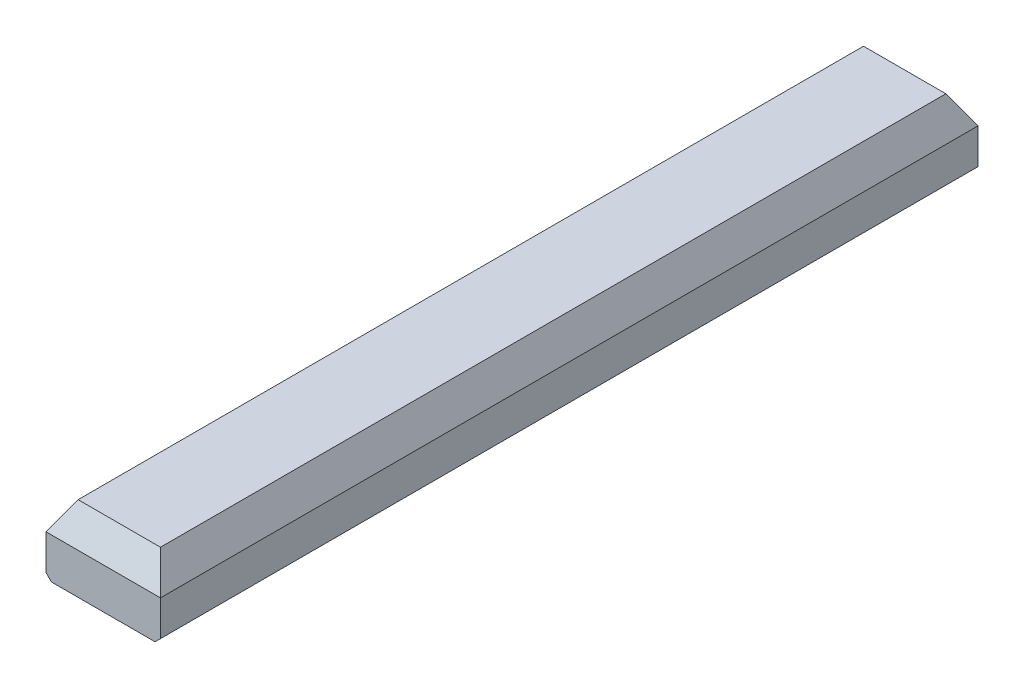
ISO-10303-21;
HEADER;
FILE_DESCRIPTION(('STEP AP214'),'2;1');
FILE_NAME('part.step','',(''),(''),'','','');
FILE_SCHEMA(('AUTOMOTIVE_DESIGN { 1 0 10303 214 1 1 1 1 }'));
ENDSEC;
DATA;
#1=APPLICATION_CONTEXT('core data for automotive mechanical design processes');
#2=APPLICATION_PROTOCOL_DEFINITION('international standard','automotive_design',2000,#1);
#3=PRODUCT_CONTEXT('',#1,'mechanical');
#4=PRODUCT('Part','Part','',(#3));
#5=PRODUCT_RELATED_PRODUCT_CATEGORY('part','',(#4));
#6=PRODUCT_DEFINITION_FORMATION('','',#4);
#7=PRODUCT_DEFINITION_CONTEXT('part definition',#1,'design');
#8=PRODUCT_DEFINITION('design','',#6,#7);
#9=PRODUCT_DEFINITION_SHAPE('','',#8);
#10=(LENGTH_UNIT() NAMED_UNIT(*) SI_UNIT(.MILLI.,.METRE.));
#11=(NAMED_UNIT(*) PLANE_ANGLE_UNIT() SI_UNIT($,.RADIAN.));
#12=(NAMED_UNIT(*) SI_UNIT($,.STERADIAN.) SOLID_ANGLE_UNIT());
#13=UNCERTAINTY_MEASURE_WITH_UNIT(LENGTH_MEASURE(1.E-05),#10,'distance_accuracy_value','');
#14=(GEOMETRIC_REPRESENTATION_CONTEXT(3) GLOBAL_UNCERTAINTY_ASSIGNED_CONTEXT((#13)) GLOBAL_UNIT_ASSIGNED_CONTEXT((#10,
#11,#12)) REPRESENTATION_CONTEXT('',''));
#15=CARTESIAN_POINT('',(0.,0.,0.));
#16=DIRECTION('',(0.,0.,1.));
#17=DIRECTION('',(1.,0.,0.));
#18=AXIS2_PLACEMENT_3D('',#15,#16,#17);
#19=CARTESIAN_POINT('',(158.4325,191.389,1131.55));
#20=DIRECTION('',(0.,-1.,0.));
#21=DIRECTION('',(0.,0.,-1.));
#22=AXIS2_PLACEMENT_3D('',#19,#20,#21);
#23=PLANE('',#22);
#24=DIRECTION('',(1.,0.,0.));
#25=VECTOR('',#24,1.);
#26=CARTESIAN_POINT('',(158.4325,191.389,1087.1));
#27=LINE('',#26,#25);
#28=CARTESIAN_POINT('',(-113.9825,191.389,1087.1));
#29=VERTEX_POINT('',#28);
#30=CARTESIAN_POINT('',(113.9825,191.389,1087.1));
#31=VERTEX_POINT('',#30);
#32=EDGE_CURVE('E176',#29,#31,#27,.T.);
#33=ORIENTED_EDGE('',*,*,#32,.T.);
#34=DIRECTION('',(0.,0.,-1.));
#35=VECTOR('',#34,1.);
#36=CARTESIAN_POINT('',(113.9825,191.389,1131.55));
#37=LINE('',#36,#35);
#38=CARTESIAN_POINT('',(113.9825,191.389,-1087.1));
#39=VERTEX_POINT('',#38);
#40=EDGE_CURVE('E177',#31,#39,#37,.T.);
#41=ORIENTED_EDGE('',*,*,#40,.T.);
#42=DIRECTION('',(-1.,0.,0.));
#43=VECTOR('',#42,1.);
#44=CARTESIAN_POINT('',(158.4325,191.389,-1087.1));
#45=LINE('',#44,#43);
#46=CARTESIAN_POINT('',(-113.9825,191.389,-1087.1));
#47=VERTEX_POINT('',#46);
#48=EDGE_CURVE('E167',#39,#47,#45,.T.);
#49=ORIENTED_EDGE('',*,*,#48,.T.);
#50=DIRECTION('',(0.,0.,1.));
#51=VECTOR('',#50,1.);
#52=CARTESIAN_POINT('',(-113.9825,191.389,1131.55));
#53=LINE('',#52,#51);
#54=EDGE_CURVE('E173',#47,#29,#53,.T.);
#55=ORIENTED_EDGE('',*,*,#54,.T.);
#56=EDGE_LOOP('',(#33,#41,#49,#55));
#57=FACE_BOUND('',#56,.T.);
#58=ADVANCED_FACE('F50',(#57),#23,.F.);
#59=CARTESIAN_POINT('',(-158.4325,191.389,1131.55));
#60=DIRECTION('',(1.,0.,0.));
#61=DIRECTION('',(0.,1.,0.));
#62=AXIS2_PLACEMENT_3D('',#59,#60,#61);
#63=PLANE('',#62);
#64=DIRECTION('',(0.,-1.,0.));
#65=VECTOR('',#64,1.);
#66=CARTESIAN_POINT('',(-158.4325,191.389,1131.55));
#67=LINE('',#66,#65);
#68=CARTESIAN_POINT('',(-158.4325,114.399341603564,1131.55));
#69=VERTEX_POINT('',#68);
#70=CARTESIAN_POINT('',(-158.4325,16.5875000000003,1131.55));
#71=VERTEX_POINT('',#70);
#72=EDGE_CURVE('E149',#69,#71,#67,.T.);
#73=ORIENTED_EDGE('',*,*,#72,.F.);
#74=DIRECTION('',(0.,0.,-1.));
#75=VECTOR('',#74,1.);
#76=CARTESIAN_POINT('',(-158.4325,114.399341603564,1131.55));
#77=LINE('',#76,#75);
#78=CARTESIAN_POINT('',(-158.4325,114.399341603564,-1131.55));
#79=VERTEX_POINT('',#78);
#80=EDGE_CURVE('E59',#69,#79,#77,.T.);
#81=ORIENTED_EDGE('',*,*,#80,.T.);
#82=DIRECTION('',(0.,-1.,0.));
#83=VECTOR('',#82,1.);
#84=CARTESIAN_POINT('',(-158.4325,191.389,-1131.55));
#85=LINE('',#84,#83);
#86=CARTESIAN_POINT('',(-158.4325,16.5875000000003,-1131.55));
#87=VERTEX_POINT('',#86);
#88=EDGE_CURVE('E141',#79,#87,#85,.T.);
#89=ORIENTED_EDGE('',*,*,#88,.T.);
#90=DIRECTION('',(0.,0.,1.));
#91=VECTOR('',#90,1.);
#92=CARTESIAN_POINT('',(-158.4325,16.5875000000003,1131.55));
#93=LINE('',#92,#91);
#94=EDGE_CURVE('E125',#87,#71,#93,.T.);
#95=ORIENTED_EDGE('',*,*,#94,.T.);
#96=EDGE_LOOP('',(#73,#81,#89,#95));
#97=FACE_BOUND('',#96,.T.);
#98=ADVANCED_FACE('F222',(#97),#63,.F.);
#99=CARTESIAN_POINT('',(-158.4325,1.58750000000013,1131.55));
#100=DIRECTION('',(0.,1.,0.));
#101=DIRECTION('',(-1.,0.,0.));
#102=AXIS2_PLACEMENT_3D('',#99,#100,#101);
#103=PLANE('',#102);
#104=DIRECTION('',(1.,0.,0.));
#105=VECTOR('',#104,1.);
#106=CARTESIAN_POINT('',(-158.4325,1.58750000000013,1131.55));
#107=LINE('',#106,#105);
#108=CARTESIAN_POINT('',(-143.4325,1.58750000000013,1131.55));
#109=VERTEX_POINT('',#108);
#110=CARTESIAN_POINT('',(143.4325,1.58750000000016,1131.55));
#111=VERTEX_POINT('',#110);
#112=EDGE_CURVE('E133',#109,#111,#107,.T.);
#113=ORIENTED_EDGE('',*,*,#112,.F.);
#114=DIRECTION('',(0.,0.,-1.));
#115=VECTOR('',#114,1.);
#116=CARTESIAN_POINT('',(-143.4325,1.58750000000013,1131.55));
#117=LINE('',#116,#115);
#118=CARTESIAN_POINT('',(-143.4325,1.58750000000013,-1131.55));
#119=VERTEX_POINT('',#118);
#120=EDGE_CURVE('E119',#109,#119,#117,.T.);
#121=ORIENTED_EDGE('',*,*,#120,.T.);
#122=DIRECTION('',(1.,0.,0.));
#123=VECTOR('',#122,1.);
#124=CARTESIAN_POINT('',(-158.4325,1.58750000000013,-1131.55));
#125=LINE('',#124,#123);
#126=CARTESIAN_POINT('',(143.4325,1.58750000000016,-1131.55));
#127=VERTEX_POINT('',#126);
#128=EDGE_CURVE('E135',#119,#127,#125,.T.);
#129=ORIENTED_EDGE('',*,*,#128,.T.);
#130=DIRECTION('',(0.,0.,1.));
#131=VECTOR('',#130,1.);
#132=CARTESIAN_POINT('',(143.4325,1.58750000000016,1131.55));
#133=LINE('',#132,#131);
#134=EDGE_CURVE('E140',#127,#111,#133,.T.);
#135=ORIENTED_EDGE('',*,*,#134,.T.);
#136=EDGE_LOOP('',(#113,#121,#129,#135));
#137=FACE_BOUND('',#136,.T.);
#138=ADVANCED_FACE('F132',(#137),#103,.F.);
#139=CARTESIAN_POINT('',(158.4325,1.58750000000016,1131.55));
#140=DIRECTION('',(-1.,0.,0.));
#141=DIRECTION('',(0.,0.,1.));
#142=AXIS2_PLACEMENT_3D('',#139,#140,#141);
#143=PLANE('',#142);
#144=DIRECTION('',(0.,1.,0.));
#145=VECTOR('',#144,1.);
#146=CARTESIAN_POINT('',(158.4325,1.58750000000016,-1131.55));
#147=LINE('',#146,#145);
#148=CARTESIAN_POINT('',(158.4325,16.5875000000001,-1131.55));
#149=VERTEX_POINT('',#148);
#150=CARTESIAN_POINT('',(158.4325,114.399341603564,-1131.55));
#151=VERTEX_POINT('',#150);
#152=EDGE_CURVE('E145',#149,#151,#147,.T.);
#153=ORIENTED_EDGE('',*,*,#152,.T.);
#154=DIRECTION('',(0.,0.,1.));
#155=VECTOR('',#154,1.);
#156=CARTESIAN_POINT('',(158.4325,114.399341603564,1131.55));
#157=LINE('',#156,#155);
#158=CARTESIAN_POINT('',(158.4325,114.399341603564,1131.55));
#159=VERTEX_POINT('',#158);
#160=EDGE_CURVE('E182',#151,#159,#157,.T.);
#161=ORIENTED_EDGE('',*,*,#160,.T.);
#162=DIRECTION('',(0.,1.,0.));
#163=VECTOR('',#162,1.);
#164=CARTESIAN_POINT('',(158.4325,1.58750000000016,1131.55));
#165=LINE('',#164,#163);
#166=CARTESIAN_POINT('',(158.4325,16.5875000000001,1131.55));
#167=VERTEX_POINT('',#166);
#168=EDGE_CURVE('E151',#167,#159,#165,.T.);
#169=ORIENTED_EDGE('',*,*,#168,.F.);
#170=DIRECTION('',(0.,0.,-1.));
#171=VECTOR('',#170,1.);
#172=CARTESIAN_POINT('',(158.4325,16.5875000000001,1131.55));
#173=LINE('',#172,#171);
#174=EDGE_CURVE('E168',#167,#149,#173,.T.);
#175=ORIENTED_EDGE('',*,*,#174,.T.);
#176=EDGE_LOOP('',(#153,#161,#169,#175));
#177=FACE_BOUND('',#176,.T.);
#178=ADVANCED_FACE('F217',(#177),#143,.F.);
#179=CARTESIAN_POINT('',(0.,0.,1131.55));
#180=DIRECTION('',(0.,0.,1.));
#181=DIRECTION('',(1.,0.,0.));
#182=AXIS2_PLACEMENT_3D('',#179,#180,#181);
#183=PLANE('',#182);
#184=ORIENTED_EDGE('',*,*,#168,.T.);
#185=DIRECTION('',(-1.,0.,0.));
#186=VECTOR('',#185,1.);
#187=CARTESIAN_POINT('',(-158.4325,114.399341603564,1131.55));
#188=LINE('',#187,#186);
#189=EDGE_CURVE('E71',#159,#69,#188,.T.);
#190=ORIENTED_EDGE('',*,*,#189,.T.);
#191=ORIENTED_EDGE('',*,*,#72,.T.);
#192=DIRECTION('',(-0.707106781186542,0.707106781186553,0.));
#193=VECTOR('',#192,1.);
#194=CARTESIAN_POINT('',(-70.922500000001,-70.9225,1131.55));
#195=LINE('',#194,#193);
#196=EDGE_CURVE('E161',#71,#109,#195,.F.);
#197=ORIENTED_EDGE('',*,*,#196,.T.);
#198=ORIENTED_EDGE('',*,*,#112,.T.);
#199=DIRECTION('',(-0.707106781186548,-0.707106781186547,0.));
#200=VECTOR('',#199,1.);
#201=CARTESIAN_POINT('',(70.9224999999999,-70.9225,1131.55));
#202=LINE('',#201,#200);
#203=EDGE_CURVE('E159',#111,#167,#202,.F.);
#204=ORIENTED_EDGE('',*,*,#203,.T.);
#205=EDGE_LOOP('',(#184,#190,#191,#197,#198,#204));
#206=FACE_BOUND('',#205,.T.);
#207=ADVANCED_FACE('F269',(#206),#183,.T.);
#208=CARTESIAN_POINT('',(0.,0.,-1131.55));
#209=DIRECTION('',(0.,0.,1.));
#210=DIRECTION('',(1.,0.,0.));
#211=AXIS2_PLACEMENT_3D('',#208,#209,#210);
#212=PLANE('',#211);
#213=ORIENTED_EDGE('',*,*,#88,.F.);
#214=DIRECTION('',(1.,0.,0.));
#215=VECTOR('',#214,1.);
#216=CARTESIAN_POINT('',(0.,114.399341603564,-1131.55));
#217=LINE('',#216,#215);
#218=EDGE_CURVE('E11',#79,#151,#217,.T.);
#219=ORIENTED_EDGE('',*,*,#218,.T.);
#220=ORIENTED_EDGE('',*,*,#152,.F.);
#221=DIRECTION('',(0.707106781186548,0.707106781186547,0.));
#222=VECTOR('',#221,1.);
#223=CARTESIAN_POINT('',(158.4325,16.5875000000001,-1131.55));
#224=LINE('',#223,#222);
#225=EDGE_CURVE('E127',#149,#127,#224,.F.);
#226=ORIENTED_EDGE('',*,*,#225,.T.);
#227=ORIENTED_EDGE('',*,*,#128,.F.);
#228=DIRECTION('',(0.707106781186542,-0.707106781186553,0.));
#229=VECTOR('',#228,1.);
#230=CARTESIAN_POINT('',(-143.4325,1.58750000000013,-1131.55));
#231=LINE('',#230,#229);
#232=EDGE_CURVE('E116',#119,#87,#231,.F.);
#233=ORIENTED_EDGE('',*,*,#232,.T.);
#234=EDGE_LOOP('',(#213,#219,#220,#226,#227,#233));
#235=FACE_BOUND('',#234,.T.);
#236=ADVANCED_FACE('F137',(#235),#212,.F.);
#237=CARTESIAN_POINT('',(-143.4325,1.58750000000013,1131.55));
#238=DIRECTION('',(0.707106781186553,0.707106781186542,0.));
#239=DIRECTION('',(0.,0.,-1.));
#240=AXIS2_PLACEMENT_3D('',#237,#238,#239);
#241=PLANE('',#240);
#242=ORIENTED_EDGE('',*,*,#196,.F.);
#243=ORIENTED_EDGE('',*,*,#94,.F.);
#244=ORIENTED_EDGE('',*,*,#232,.F.);
#245=ORIENTED_EDGE('',*,*,#120,.F.);
#246=EDGE_LOOP('',(#242,#243,#244,#245));
#247=FACE_BOUND('',#246,.T.);
#248=ADVANCED_FACE('F118',(#247),#241,.F.);
#249=CARTESIAN_POINT('',(158.4325,16.5875000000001,1131.55));
#250=DIRECTION('',(-0.707106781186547,0.707106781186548,0.));
#251=DIRECTION('',(0.,0.,-1.));
#252=AXIS2_PLACEMENT_3D('',#249,#250,#251);
#253=PLANE('',#252);
#254=ORIENTED_EDGE('',*,*,#203,.F.);
#255=ORIENTED_EDGE('',*,*,#134,.F.);
#256=ORIENTED_EDGE('',*,*,#225,.F.);
#257=ORIENTED_EDGE('',*,*,#174,.F.);
#258=EDGE_LOOP('',(#254,#255,#256,#257));
#259=FACE_BOUND('',#258,.T.);
#260=ADVANCED_FACE('F237',(#259),#253,.F.);
#261=CARTESIAN_POINT('',(-158.4325,114.399341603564,1131.55));
#262=DIRECTION('',(0.866025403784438,-0.500000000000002,0.));
#263=DIRECTION('',(0.,0.,-1.));
#264=AXIS2_PLACEMENT_3D('',#261,#262,#263);
#265=PLANE('',#264);
#266=DIRECTION('',(0.447213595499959,0.774596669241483,0.447213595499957));
#267=VECTOR('',#266,1.);
#268=CARTESIAN_POINT('',(-59.4994999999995,285.756324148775,-1032.617));
#269=LINE('',#268,#267);
#270=EDGE_CURVE('E197',#79,#47,#269,.T.);
#271=ORIENTED_EDGE('',*,*,#270,.F.);
#272=ORIENTED_EDGE('',*,*,#80,.F.);
#273=DIRECTION('',(-0.447213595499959,-0.774596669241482,0.447213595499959));
#274=VECTOR('',#273,1.);
#275=CARTESIAN_POINT('',(-158.4325,114.399341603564,1131.55));
#276=LINE('',#275,#274);
#277=EDGE_CURVE('E55',#29,#69,#276,.T.);
#278=ORIENTED_EDGE('',*,*,#277,.F.);
#279=ORIENTED_EDGE('',*,*,#54,.F.);
#280=EDGE_LOOP('',(#271,#272,#278,#279));
#281=FACE_BOUND('',#280,.T.);
#282=ADVANCED_FACE('F49',(#281),#265,.F.);
#283=CARTESIAN_POINT('',(0.,114.399341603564,1131.55));
#284=DIRECTION('',(0.,0.500000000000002,0.866025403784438));
#285=DIRECTION('',(1.,0.,0.));
#286=AXIS2_PLACEMENT_3D('',#283,#284,#285);
#287=PLANE('',#286);
#288=ORIENTED_EDGE('',*,*,#277,.T.);
#289=ORIENTED_EDGE('',*,*,#189,.F.);
#290=DIRECTION('',(0.447213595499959,-0.774596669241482,0.447213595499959));
#291=VECTOR('',#290,1.);
#292=CARTESIAN_POINT('',(126.746,169.281969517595,1099.8635));
#293=LINE('',#292,#291);
#294=EDGE_CURVE('E191',#31,#159,#293,.T.);
#295=ORIENTED_EDGE('',*,*,#294,.F.);
#296=ORIENTED_EDGE('',*,*,#32,.F.);
#297=EDGE_LOOP('',(#288,#289,#295,#296));
#298=FACE_BOUND('',#297,.T.);
#299=ADVANCED_FACE('F206',(#298),#287,.T.);
#300=CARTESIAN_POINT('',(158.4325,191.389,-1087.1));
#301=DIRECTION('',(0.,-0.5,0.866025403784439));
#302=DIRECTION('',(-1.,0.,0.));
#303=AXIS2_PLACEMENT_3D('',#300,#301,#302);
#304=PLANE('',#303);
#305=ORIENTED_EDGE('',*,*,#270,.T.);
#306=ORIENTED_EDGE('',*,*,#48,.F.);
#307=DIRECTION('',(0.447213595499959,-0.774596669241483,-0.447213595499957));
#308=VECTOR('',#307,1.);
#309=CARTESIAN_POINT('',(122.8725,175.991068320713,-1095.99));
#310=LINE('',#309,#308);
#311=EDGE_CURVE('E192',#151,#39,#310,.F.);
#312=ORIENTED_EDGE('',*,*,#311,.F.);
#313=ORIENTED_EDGE('',*,*,#218,.F.);
#314=EDGE_LOOP('',(#305,#306,#312,#313));
#315=FACE_BOUND('',#314,.T.);
#316=ADVANCED_FACE('F214',(#315),#304,.F.);
#317=CARTESIAN_POINT('',(113.9825,191.389,1131.55));
#318=DIRECTION('',(-0.866025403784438,-0.500000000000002,0.));
#319=DIRECTION('',(0.,0.,-1.));
#320=AXIS2_PLACEMENT_3D('',#317,#318,#319);
#321=PLANE('',#320);
#322=ORIENTED_EDGE('',*,*,#294,.T.);
#323=ORIENTED_EDGE('',*,*,#160,.F.);
#324=ORIENTED_EDGE('',*,*,#311,.T.);
#325=ORIENTED_EDGE('',*,*,#40,.F.);
#326=EDGE_LOOP('',(#322,#323,#324,#325));
#327=FACE_BOUND('',#326,.T.);
#328=ADVANCED_FACE('F218',(#327),#321,.F.);
#329=CLOSED_SHELL('',(#58,#98,#138,#178,#207,#236,#248,#260,#282,#299,#316,#328));
#330=MANIFOLD_SOLID_BREP('B2',#329);
#331=ADVANCED_BREP_SHAPE_REPRESENTATION('',(#18,#330),#14);
#332=SHAPE_DEFINITION_REPRESENTATION(#9,#331);
ENDSEC;
END-ISO-10303-21;
